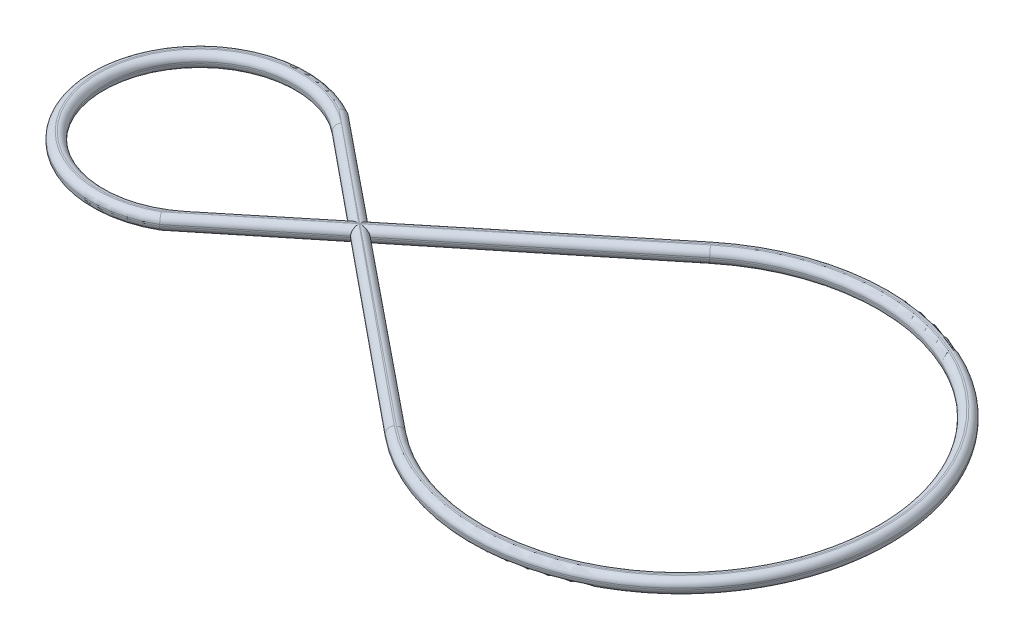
ISO-10303-21;
HEADER;
FILE_DESCRIPTION(('STEP AP214'),'2;1');
FILE_NAME('part.step','',(''),(''),'','','');
FILE_SCHEMA(('AUTOMOTIVE_DESIGN { 1 0 10303 214 1 1 1 1 }'));
ENDSEC;
DATA;
#1=APPLICATION_CONTEXT('core data for automotive mechanical design processes');
#2=APPLICATION_PROTOCOL_DEFINITION('international standard','automotive_design',2000,#1);
#3=PRODUCT_CONTEXT('',#1,'mechanical');
#4=PRODUCT('Part','Part','',(#3));
#5=PRODUCT_RELATED_PRODUCT_CATEGORY('part','',(#4));
#6=PRODUCT_DEFINITION_FORMATION('','',#4);
#7=PRODUCT_DEFINITION_CONTEXT('part definition',#1,'design');
#8=PRODUCT_DEFINITION('design','',#6,#7);
#9=PRODUCT_DEFINITION_SHAPE('','',#8);
#10=(LENGTH_UNIT() NAMED_UNIT(*) SI_UNIT(.MILLI.,.METRE.));
#11=(NAMED_UNIT(*) PLANE_ANGLE_UNIT() SI_UNIT($,.RADIAN.));
#12=(NAMED_UNIT(*) SI_UNIT($,.STERADIAN.) SOLID_ANGLE_UNIT());
#13=UNCERTAINTY_MEASURE_WITH_UNIT(LENGTH_MEASURE(1.E-05),#10,'distance_accuracy_value','');
#14=(GEOMETRIC_REPRESENTATION_CONTEXT(3) GLOBAL_UNCERTAINTY_ASSIGNED_CONTEXT((#13)) GLOBAL_UNIT_ASSIGNED_CONTEXT((#10,
#11,#12)) REPRESENTATION_CONTEXT('',''));
#15=CARTESIAN_POINT('',(0.,0.,0.));
#16=DIRECTION('',(0.,0.,1.));
#17=DIRECTION('',(1.,0.,0.));
#18=AXIS2_PLACEMENT_3D('',#15,#16,#17);
#19=CARTESIAN_POINT('',(166.,5.,0.));
#20=DIRECTION('',(0.,1.,0.));
#21=DIRECTION('',(0.,0.,1.));
#22=AXIS2_PLACEMENT_3D('',#19,#20,#21);
#23=PLANE('',#22);
#24=DIRECTION('',(-0.776849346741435,0.,0.629686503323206));
#25=VECTOR('',#24,1.);
#26=CARTESIAN_POINT('',(122.079366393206,5.,-54.1852419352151));
#27=LINE('',#26,#25);
#28=CARTESIAN_POINT('',(55.2305939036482,5.,0.));
#29=VERTEX_POINT('',#28);
#30=CARTESIAN_POINT('',(122.079366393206,5.,-54.185241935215));
#31=VERTEX_POINT('',#30);
#32=EDGE_CURVE('E287',#29,#31,#27,.F.);
#33=ORIENTED_EDGE('',*,*,#32,.T.);
#34=CARTESIAN_POINT('',(166.,5.,0.));
#35=DIRECTION('',(0.,1.,0.));
#36=DIRECTION('',(0.,0.,1.));
#37=AXIS2_PLACEMENT_3D('',#34,#35,#36);
#38=CIRCLE('',#37,69.75);
#39=CARTESIAN_POINT('',(122.079366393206,5.,54.1852419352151));
#40=VERTEX_POINT('',#39);
#41=EDGE_CURVE('E289',#31,#40,#38,.F.);
#42=ORIENTED_EDGE('',*,*,#41,.T.);
#43=DIRECTION('',(0.776849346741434,0.,0.629686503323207));
#44=VECTOR('',#43,1.);
#45=CARTESIAN_POINT('',(122.079366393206,5.,54.1852419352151));
#46=LINE('',#45,#44);
#47=EDGE_CURVE('E285',#40,#29,#46,.F.);
#48=ORIENTED_EDGE('',*,*,#47,.T.);
#49=EDGE_LOOP('',(#33,#42,#48));
#50=FACE_BOUND('',#49,.T.);
#51=DIRECTION('',(-0.774535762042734,0.,-0.632530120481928));
#52=VECTOR('',#51,1.);
#53=CARTESIAN_POINT('',(121.564759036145,5.,54.411137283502));
#54=LINE('',#53,#52);
#55=CARTESIAN_POINT('',(21.980421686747,5.,-26.915117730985));
#56=VERTEX_POINT('',#55);
#57=CARTESIAN_POINT('',(54.9380952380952,5.,0.));
#58=VERTEX_POINT('',#57);
#59=EDGE_CURVE('E280',#56,#58,#54,.F.);
#60=ORIENTED_EDGE('',*,*,#59,.T.);
#61=DIRECTION('',(0.774535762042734,0.,-0.632530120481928));
#62=VECTOR('',#61,1.);
#63=CARTESIAN_POINT('',(121.564759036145,5.,-54.411137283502));
#64=LINE('',#63,#62);
#65=CARTESIAN_POINT('',(21.980421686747,5.,26.915117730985));
#66=VERTEX_POINT('',#65);
#67=EDGE_CURVE('E282',#58,#66,#64,.F.);
#68=ORIENTED_EDGE('',*,*,#67,.T.);
#69=CARTESIAN_POINT('',(0.,5.,0.));
#70=DIRECTION('',(0.,1.,0.));
#71=DIRECTION('',(0.,0.,1.));
#72=AXIS2_PLACEMENT_3D('',#69,#70,#71);
#73=CIRCLE('',#72,34.75);
#74=EDGE_CURVE('E278',#66,#56,#73,.F.);
#75=ORIENTED_EDGE('',*,*,#74,.T.);
#76=EDGE_LOOP('',(#60,#68,#75));
#77=FACE_BOUND('',#76,.T.);
#78=DIRECTION('',(0.774535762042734,0.,0.632530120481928));
#79=VECTOR('',#78,1.);
#80=CARTESIAN_POINT('',(121.564759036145,5.,54.411137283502));
#81=LINE('',#80,#79);
#82=CARTESIAN_POINT('',(55.0837969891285,5.,0.118988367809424));
#83=VERTEX_POINT('',#82);
#84=CARTESIAN_POINT('',(121.564759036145,5.,54.411137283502));
#85=VERTEX_POINT('',#84);
#86=EDGE_CURVE('E271',#83,#85,#81,.T.);
#87=ORIENTED_EDGE('',*,*,#86,.T.);
#88=CARTESIAN_POINT('',(166.,5.,0.));
#89=DIRECTION('',(0.,1.,0.));
#90=DIRECTION('',(0.,0.,1.));
#91=AXIS2_PLACEMENT_3D('',#88,#89,#90);
#92=CIRCLE('',#91,70.25);
#93=CARTESIAN_POINT('',(121.564759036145,5.,-54.411137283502));
#94=VERTEX_POINT('',#93);
#95=EDGE_CURVE('E275',#85,#94,#92,.T.);
#96=ORIENTED_EDGE('',*,*,#95,.T.);
#97=DIRECTION('',(-0.774535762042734,0.,0.632530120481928));
#98=VECTOR('',#97,1.);
#99=CARTESIAN_POINT('',(56.5016730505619,5.,-1.27690690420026));
#100=LINE('',#99,#98);
#101=CARTESIAN_POINT('',(55.0837969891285,5.,-0.118988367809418));
#102=VERTEX_POINT('',#101);
#103=EDGE_CURVE('E273',#94,#102,#100,.T.);
#104=ORIENTED_EDGE('',*,*,#103,.T.);
#105=DIRECTION('',(-0.776849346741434,0.,-0.629686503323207));
#106=VECTOR('',#105,1.);
#107=CARTESIAN_POINT('',(17.2914923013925,5.,-30.7520889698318));
#108=LINE('',#107,#106);
#109=CARTESIAN_POINT('',(17.4327651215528,5.,-30.6375782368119));
#110=VERTEX_POINT('',#109);
#111=EDGE_CURVE('E267',#102,#110,#108,.T.);
#112=ORIENTED_EDGE('',*,*,#111,.T.);
#113=CARTESIAN_POINT('',(0.,5.,0.));
#114=DIRECTION('',(0.,1.,0.));
#115=DIRECTION('',(0.,0.,1.));
#116=AXIS2_PLACEMENT_3D('',#113,#114,#115);
#117=CIRCLE('',#116,35.25);
#118=CARTESIAN_POINT('',(17.4327651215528,5.,30.6375782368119));
#119=VERTEX_POINT('',#118);
#120=EDGE_CURVE('E265',#110,#119,#117,.T.);
#121=ORIENTED_EDGE('',*,*,#120,.T.);
#122=DIRECTION('',(0.776849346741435,0.,-0.629686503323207));
#123=VECTOR('',#122,1.);
#124=CARTESIAN_POINT('',(53.6616856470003,5.,1.27170133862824));
#125=LINE('',#124,#123);
#126=EDGE_CURVE('E269',#119,#83,#125,.T.);
#127=ORIENTED_EDGE('',*,*,#126,.T.);
#128=EDGE_LOOP('',(#87,#96,#104,#112,#121,#127));
#129=FACE_BOUND('',#128,.T.);
#130=ADVANCED_FACE('F27',(#50,#77,#129),#23,.T.);
#131=CARTESIAN_POINT('',(166.,0.,0.));
#132=DIRECTION('',(0.,1.,0.));
#133=DIRECTION('',(0.,0.,1.));
#134=AXIS2_PLACEMENT_3D('',#131,#132,#133);
#135=PLANE('',#134);
#136=DIRECTION('',(0.776849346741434,0.,0.629686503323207));
#137=VECTOR('',#136,1.);
#138=CARTESIAN_POINT('',(122.079366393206,0.,54.1852419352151));
#139=LINE('',#138,#137);
#140=CARTESIAN_POINT('',(55.2305939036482,0.,0.));
#141=VERTEX_POINT('',#140);
#142=CARTESIAN_POINT('',(122.079366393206,0.,54.1852419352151));
#143=VERTEX_POINT('',#142);
#144=EDGE_CURVE('E230',#141,#143,#139,.T.);
#145=ORIENTED_EDGE('',*,*,#144,.T.);
#146=CARTESIAN_POINT('',(166.,0.,0.));
#147=DIRECTION('',(0.,1.,0.));
#148=DIRECTION('',(0.,0.,1.));
#149=AXIS2_PLACEMENT_3D('',#146,#147,#148);
#150=CIRCLE('',#149,69.75);
#151=CARTESIAN_POINT('',(122.079366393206,0.,-54.1852419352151));
#152=VERTEX_POINT('',#151);
#153=EDGE_CURVE('E234',#143,#152,#150,.T.);
#154=ORIENTED_EDGE('',*,*,#153,.T.);
#155=DIRECTION('',(-0.776849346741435,0.,0.629686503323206));
#156=VECTOR('',#155,1.);
#157=CARTESIAN_POINT('',(57.3870059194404,0.,-1.74791103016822));
#158=LINE('',#157,#156);
#159=EDGE_CURVE('E232',#152,#141,#158,.T.);
#160=ORIENTED_EDGE('',*,*,#159,.T.);
#161=EDGE_LOOP('',(#145,#154,#160));
#162=FACE_BOUND('',#161,.T.);
#163=DIRECTION('',(-0.774535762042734,0.,0.632530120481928));
#164=VECTOR('',#163,1.);
#165=CARTESIAN_POINT('',(121.564759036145,0.,-54.411137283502));
#166=LINE('',#165,#164);
#167=CARTESIAN_POINT('',(55.0837969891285,0.,-0.118988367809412));
#168=VERTEX_POINT('',#167);
#169=CARTESIAN_POINT('',(121.564759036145,0.,-54.411137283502));
#170=VERTEX_POINT('',#169);
#171=EDGE_CURVE('E223',#168,#170,#166,.F.);
#172=ORIENTED_EDGE('',*,*,#171,.T.);
#173=CARTESIAN_POINT('',(166.,0.,0.));
#174=DIRECTION('',(0.,1.,0.));
#175=DIRECTION('',(0.,0.,1.));
#176=AXIS2_PLACEMENT_3D('',#173,#174,#175);
#177=CIRCLE('',#176,70.25);
#178=CARTESIAN_POINT('',(121.564759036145,0.,54.411137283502));
#179=VERTEX_POINT('',#178);
#180=EDGE_CURVE('E228',#170,#179,#177,.F.);
#181=ORIENTED_EDGE('',*,*,#180,.T.);
#182=DIRECTION('',(0.774535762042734,0.,0.632530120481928));
#183=VECTOR('',#182,1.);
#184=CARTESIAN_POINT('',(121.564759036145,0.,54.411137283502));
#185=LINE('',#184,#183);
#186=CARTESIAN_POINT('',(55.0837969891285,0.,0.118988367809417));
#187=VERTEX_POINT('',#186);
#188=EDGE_CURVE('E225',#179,#187,#185,.F.);
#189=ORIENTED_EDGE('',*,*,#188,.T.);
#190=DIRECTION('',(0.776849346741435,0.,-0.629686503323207));
#191=VECTOR('',#190,1.);
#192=CARTESIAN_POINT('',(122.079366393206,0.,-54.1852419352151));
#193=LINE('',#192,#191);
#194=CARTESIAN_POINT('',(17.4327651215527,0.,30.637578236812));
#195=VERTEX_POINT('',#194);
#196=EDGE_CURVE('E221',#187,#195,#193,.F.);
#197=ORIENTED_EDGE('',*,*,#196,.T.);
#198=CARTESIAN_POINT('',(0.,0.,0.));
#199=DIRECTION('',(0.,1.,0.));
#200=DIRECTION('',(0.,0.,1.));
#201=AXIS2_PLACEMENT_3D('',#198,#199,#200);
#202=CIRCLE('',#201,35.25);
#203=CARTESIAN_POINT('',(17.4327651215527,0.,-30.637578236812));
#204=VERTEX_POINT('',#203);
#205=EDGE_CURVE('E214',#195,#204,#202,.F.);
#206=ORIENTED_EDGE('',*,*,#205,.T.);
#207=DIRECTION('',(-0.776849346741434,0.,-0.629686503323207));
#208=VECTOR('',#207,1.);
#209=CARTESIAN_POINT('',(122.079366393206,0.,54.1852419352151));
#210=LINE('',#209,#208);
#211=EDGE_CURVE('E216',#204,#168,#210,.F.);
#212=ORIENTED_EDGE('',*,*,#211,.T.);
#213=EDGE_LOOP('',(#172,#181,#189,#197,#206,#212));
#214=FACE_BOUND('',#213,.T.);
#215=DIRECTION('',(0.774535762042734,0.,-0.632530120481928));
#216=VECTOR('',#215,1.);
#217=CARTESIAN_POINT('',(52.8041451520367,0.,1.74270546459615));
#218=LINE('',#217,#216);
#219=CARTESIAN_POINT('',(21.980421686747,0.,26.915117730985));
#220=VERTEX_POINT('',#219);
#221=CARTESIAN_POINT('',(54.9380952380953,0.,0.));
#222=VERTEX_POINT('',#221);
#223=EDGE_CURVE('E209',#220,#222,#218,.T.);
#224=ORIENTED_EDGE('',*,*,#223,.T.);
#225=DIRECTION('',(-0.774535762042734,0.,-0.632530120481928));
#226=VECTOR('',#225,1.);
#227=CARTESIAN_POINT('',(21.980421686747,0.,-26.9151177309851));
#228=LINE('',#227,#226);
#229=CARTESIAN_POINT('',(21.980421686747,0.,-26.915117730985));
#230=VERTEX_POINT('',#229);
#231=EDGE_CURVE('E194',#222,#230,#228,.T.);
#232=ORIENTED_EDGE('',*,*,#231,.T.);
#233=CARTESIAN_POINT('',(0.,0.,0.));
#234=DIRECTION('',(0.,1.,0.));
#235=DIRECTION('',(0.,0.,1.));
#236=AXIS2_PLACEMENT_3D('',#233,#234,#235);
#237=CIRCLE('',#236,34.75);
#238=EDGE_CURVE('E203',#230,#220,#237,.T.);
#239=ORIENTED_EDGE('',*,*,#238,.T.);
#240=EDGE_LOOP('',(#224,#232,#239));
#241=FACE_BOUND('',#240,.T.);
#242=ADVANCED_FACE('F212',(#162,#214,#241),#135,.F.);
#243=CARTESIAN_POINT('',(166.,5.,0.));
#244=DIRECTION('',(0.,-1.,0.));
#245=DIRECTION('',(0.,0.,-1.));
#246=AXIS2_PLACEMENT_3D('',#243,#244,#245);
#247=CYLINDRICAL_SURFACE('',#246,72.5);
#248=DIRECTION('',(0.,-1.,0.));
#249=VECTOR('',#248,1.);
#250=CARTESIAN_POINT('',(120.14156626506,5.,56.1538427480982));
#251=LINE('',#250,#249);
#252=CARTESIAN_POINT('',(120.14156626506,2.75,56.1538427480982));
#253=VERTEX_POINT('',#252);
#254=CARTESIAN_POINT('',(120.14156626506,2.25,56.1538427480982));
#255=VERTEX_POINT('',#254);
#256=EDGE_CURVE('E328',#253,#255,#251,.T.);
#257=ORIENTED_EDGE('',*,*,#256,.T.);
#258=CARTESIAN_POINT('',(166.,2.25,0.));
#259=DIRECTION('',(0.,1.,0.));
#260=DIRECTION('',(0.,0.,1.));
#261=AXIS2_PLACEMENT_3D('',#258,#259,#260);
#262=CIRCLE('',#261,72.5);
#263=CARTESIAN_POINT('',(120.14156626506,2.25,-56.1538427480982));
#264=VERTEX_POINT('',#263);
#265=EDGE_CURVE('E257',#255,#264,#262,.T.);
#266=ORIENTED_EDGE('',*,*,#265,.T.);
#267=DIRECTION('',(0.,-1.,0.));
#268=VECTOR('',#267,1.);
#269=CARTESIAN_POINT('',(120.14156626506,5.,-56.1538427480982));
#270=LINE('',#269,#268);
#271=CARTESIAN_POINT('',(120.14156626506,2.75,-56.1538427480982));
#272=VERTEX_POINT('',#271);
#273=EDGE_CURVE('E210',#272,#264,#270,.T.);
#274=ORIENTED_EDGE('',*,*,#273,.F.);
#275=CARTESIAN_POINT('',(166.,2.75,0.));
#276=DIRECTION('',(0.,1.,0.));
#277=DIRECTION('',(0.,0.,1.));
#278=AXIS2_PLACEMENT_3D('',#275,#276,#277);
#279=CIRCLE('',#278,72.5);
#280=EDGE_CURVE('E254',#272,#253,#279,.F.);
#281=ORIENTED_EDGE('',*,*,#280,.T.);
#282=EDGE_LOOP('',(#257,#266,#274,#281));
#283=FACE_BOUND('',#282,.T.);
#284=ADVANCED_FACE('F29',(#283),#247,.T.);
#285=CARTESIAN_POINT('',(55.0784802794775,5.,-3.01961236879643));
#286=DIRECTION('',(0.632530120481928,0.,0.774535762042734));
#287=DIRECTION('',(0.774535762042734,0.,-0.632530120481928));
#288=AXIS2_PLACEMENT_3D('',#285,#286,#287);
#289=PLANE('',#288);
#290=ORIENTED_EDGE('',*,*,#273,.T.);
#291=DIRECTION('',(-0.774535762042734,0.,0.632530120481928));
#292=VECTOR('',#291,1.);
#293=CARTESIAN_POINT('',(55.0784802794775,2.25,-3.01961236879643));
#294=LINE('',#293,#292);
#295=CARTESIAN_POINT('',(55.0784802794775,2.25,-3.01961236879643));
#296=VERTEX_POINT('',#295);
#297=EDGE_CURVE('E252',#264,#296,#294,.T.);
#298=ORIENTED_EDGE('',*,*,#297,.T.);
#299=DIRECTION('',(0.,-1.,0.));
#300=VECTOR('',#299,1.);
#301=CARTESIAN_POINT('',(55.0784802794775,5.,-3.01961236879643));
#302=LINE('',#301,#300);
#303=CARTESIAN_POINT('',(55.0784802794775,2.75,-3.01961236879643));
#304=VERTEX_POINT('',#303);
#305=EDGE_CURVE('E363',#304,#296,#302,.T.);
#306=ORIENTED_EDGE('',*,*,#305,.F.);
#307=DIRECTION('',(-0.774535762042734,0.,0.632530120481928));
#308=VECTOR('',#307,1.);
#309=CARTESIAN_POINT('',(120.14156626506,2.75,-56.1538427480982));
#310=LINE('',#309,#308);
#311=EDGE_CURVE('E250',#304,#272,#310,.F.);
#312=ORIENTED_EDGE('',*,*,#311,.T.);
#313=EDGE_LOOP('',(#290,#298,#306,#312));
#314=FACE_BOUND('',#313,.T.);
#315=ADVANCED_FACE('F369',(#314),#289,.F.);
#316=CARTESIAN_POINT('',(18.7082869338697,5.,-32.5));
#317=DIRECTION('',(-0.629686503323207,0.,0.776849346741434));
#318=DIRECTION('',(0.776849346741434,0.,0.629686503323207));
#319=AXIS2_PLACEMENT_3D('',#316,#317,#318);
#320=PLANE('',#319);
#321=DIRECTION('',(0.,-1.,0.));
#322=VECTOR('',#321,1.);
#323=CARTESIAN_POINT('',(18.7082869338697,5.,-32.5));
#324=LINE('',#323,#322);
#325=CARTESIAN_POINT('',(18.7082869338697,2.75,-32.5));
#326=VERTEX_POINT('',#325);
#327=CARTESIAN_POINT('',(18.7082869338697,2.25,-32.5));
#328=VERTEX_POINT('',#327);
#329=EDGE_CURVE('E361',#326,#328,#324,.T.);
#330=ORIENTED_EDGE('',*,*,#329,.F.);
#331=DIRECTION('',(-0.776849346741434,0.,-0.629686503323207));
#332=VECTOR('',#331,1.);
#333=CARTESIAN_POINT('',(55.0784802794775,2.75,-3.01961236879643));
#334=LINE('',#333,#332);
#335=EDGE_CURVE('E305',#326,#304,#334,.F.);
#336=ORIENTED_EDGE('',*,*,#335,.T.);
#337=ORIENTED_EDGE('',*,*,#305,.T.);
#338=DIRECTION('',(-0.776849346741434,0.,-0.629686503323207));
#339=VECTOR('',#338,1.);
#340=CARTESIAN_POINT('',(18.7082869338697,2.25,-32.5));
#341=LINE('',#340,#339);
#342=EDGE_CURVE('E42',#296,#328,#341,.T.);
#343=ORIENTED_EDGE('',*,*,#342,.T.);
#344=EDGE_LOOP('',(#330,#336,#337,#343));
#345=FACE_BOUND('',#344,.T.);
#346=ADVANCED_FACE('F466',(#345),#320,.F.);
#347=CARTESIAN_POINT('',(0.,5.,0.));
#348=DIRECTION('',(0.,-1.,0.));
#349=DIRECTION('',(0.,0.,-1.));
#350=AXIS2_PLACEMENT_3D('',#347,#348,#349);
#351=CYLINDRICAL_SURFACE('',#350,37.5);
#352=ORIENTED_EDGE('',*,*,#329,.T.);
#353=CARTESIAN_POINT('',(0.,2.25,0.));
#354=DIRECTION('',(0.,1.,0.));
#355=DIRECTION('',(0.,0.,1.));
#356=AXIS2_PLACEMENT_3D('',#353,#354,#355);
#357=CIRCLE('',#356,37.5);
#358=CARTESIAN_POINT('',(18.7082869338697,2.25,32.5));
#359=VERTEX_POINT('',#358);
#360=EDGE_CURVE('E308',#328,#359,#357,.T.);
#361=ORIENTED_EDGE('',*,*,#360,.T.);
#362=DIRECTION('',(0.,-1.,0.));
#363=VECTOR('',#362,1.);
#364=CARTESIAN_POINT('',(18.7082869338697,5.,32.5));
#365=LINE('',#364,#363);
#366=CARTESIAN_POINT('',(18.7082869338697,2.75,32.5));
#367=VERTEX_POINT('',#366);
#368=EDGE_CURVE('E358',#367,#359,#365,.T.);
#369=ORIENTED_EDGE('',*,*,#368,.F.);
#370=CARTESIAN_POINT('',(0.,2.75,0.));
#371=DIRECTION('',(0.,1.,0.));
#372=DIRECTION('',(0.,0.,1.));
#373=AXIS2_PLACEMENT_3D('',#370,#371,#372);
#374=CIRCLE('',#373,37.5);
#375=EDGE_CURVE('E49',#367,#326,#374,.F.);
#376=ORIENTED_EDGE('',*,*,#375,.T.);
#377=EDGE_LOOP('',(#352,#361,#369,#376));
#378=FACE_BOUND('',#377,.T.);
#379=ADVANCED_FACE('F462',(#378),#351,.T.);
#380=CARTESIAN_POINT('',(18.7082869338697,5.,32.5));
#381=DIRECTION('',(-0.629686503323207,0.,-0.776849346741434));
#382=DIRECTION('',(-0.776849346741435,0.,0.629686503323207));
#383=AXIS2_PLACEMENT_3D('',#380,#381,#382);
#384=PLANE('',#383);
#385=ORIENTED_EDGE('',*,*,#368,.T.);
#386=DIRECTION('',(0.776849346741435,0.,-0.629686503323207));
#387=VECTOR('',#386,1.);
#388=CARTESIAN_POINT('',(18.7082869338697,2.25,32.5));
#389=LINE('',#388,#387);
#390=CARTESIAN_POINT('',(55.0784802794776,2.25,3.01961236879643));
#391=VERTEX_POINT('',#390);
#392=EDGE_CURVE('E302',#359,#391,#389,.T.);
#393=ORIENTED_EDGE('',*,*,#392,.T.);
#394=DIRECTION('',(0.,-1.,0.));
#395=VECTOR('',#394,1.);
#396=CARTESIAN_POINT('',(55.0784802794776,5.,3.01961236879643));
#397=LINE('',#396,#395);
#398=CARTESIAN_POINT('',(55.0784802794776,2.75,3.01961236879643));
#399=VERTEX_POINT('',#398);
#400=EDGE_CURVE('E355',#399,#391,#397,.T.);
#401=ORIENTED_EDGE('',*,*,#400,.F.);
#402=DIRECTION('',(0.776849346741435,0.,-0.629686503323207));
#403=VECTOR('',#402,1.);
#404=CARTESIAN_POINT('',(18.7082869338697,2.75,32.5));
#405=LINE('',#404,#403);
#406=EDGE_CURVE('E300',#399,#367,#405,.F.);
#407=ORIENTED_EDGE('',*,*,#406,.T.);
#408=EDGE_LOOP('',(#385,#393,#401,#407));
#409=FACE_BOUND('',#408,.T.);
#410=ADVANCED_FACE('F458',(#409),#384,.F.);
#411=CARTESIAN_POINT('',(55.0784802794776,5.,3.01961236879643));
#412=DIRECTION('',(0.632530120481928,0.,-0.774535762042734));
#413=DIRECTION('',(-0.774535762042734,0.,-0.632530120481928));
#414=AXIS2_PLACEMENT_3D('',#411,#412,#413);
#415=PLANE('',#414);
#416=ORIENTED_EDGE('',*,*,#400,.T.);
#417=DIRECTION('',(0.774535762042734,0.,0.632530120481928));
#418=VECTOR('',#417,1.);
#419=CARTESIAN_POINT('',(55.0784802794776,2.25,3.01961236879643));
#420=LINE('',#419,#418);
#421=EDGE_CURVE('E247',#391,#255,#420,.T.);
#422=ORIENTED_EDGE('',*,*,#421,.T.);
#423=ORIENTED_EDGE('',*,*,#256,.F.);
#424=DIRECTION('',(0.774535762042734,0.,0.632530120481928));
#425=VECTOR('',#424,1.);
#426=CARTESIAN_POINT('',(55.0784802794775,2.75,3.01961236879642));
#427=LINE('',#426,#425);
#428=EDGE_CURVE('E245',#253,#399,#427,.F.);
#429=ORIENTED_EDGE('',*,*,#428,.T.);
#430=EDGE_LOOP('',(#416,#422,#423,#429));
#431=FACE_BOUND('',#430,.T.);
#432=ADVANCED_FACE('F449',(#431),#415,.F.);
#433=CARTESIAN_POINT('',(0.,5.,0.));
#434=DIRECTION('',(0.,-1.,0.));
#435=DIRECTION('',(0.,0.,-1.));
#436=AXIS2_PLACEMENT_3D('',#433,#434,#435);
#437=CYLINDRICAL_SURFACE('',#436,32.5);
#438=DIRECTION('',(0.,-1.,0.));
#439=VECTOR('',#438,1.);
#440=CARTESIAN_POINT('',(20.5572289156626,5.,25.1724122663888));
#441=LINE('',#440,#439);
#442=CARTESIAN_POINT('',(20.5572289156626,2.75,25.1724122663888));
#443=VERTEX_POINT('',#442);
#444=CARTESIAN_POINT('',(20.5572289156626,2.25,25.1724122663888));
#445=VERTEX_POINT('',#444);
#446=EDGE_CURVE('E315',#443,#445,#441,.T.);
#447=ORIENTED_EDGE('',*,*,#446,.T.);
#448=CARTESIAN_POINT('',(0.,2.25,0.));
#449=DIRECTION('',(0.,1.,0.));
#450=DIRECTION('',(0.,0.,1.));
#451=AXIS2_PLACEMENT_3D('',#448,#449,#450);
#452=CIRCLE('',#451,32.5);
#453=CARTESIAN_POINT('',(20.5572289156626,2.25,-25.1724122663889));
#454=VERTEX_POINT('',#453);
#455=EDGE_CURVE('E11',#445,#454,#452,.F.);
#456=ORIENTED_EDGE('',*,*,#455,.T.);
#457=DIRECTION('',(0.,-1.,0.));
#458=VECTOR('',#457,1.);
#459=CARTESIAN_POINT('',(20.5572289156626,5.,-25.1724122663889));
#460=LINE('',#459,#458);
#461=CARTESIAN_POINT('',(20.5572289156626,2.75,-25.1724122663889));
#462=VERTEX_POINT('',#461);
#463=EDGE_CURVE('E317',#462,#454,#460,.T.);
#464=ORIENTED_EDGE('',*,*,#463,.F.);
#465=CARTESIAN_POINT('',(0.,2.75,0.));
#466=DIRECTION('',(0.,1.,0.));
#467=DIRECTION('',(0.,0.,1.));
#468=AXIS2_PLACEMENT_3D('',#465,#466,#467);
#469=CIRCLE('',#468,32.5);
#470=EDGE_CURVE('E35',#462,#443,#469,.T.);
#471=ORIENTED_EDGE('',*,*,#470,.T.);
#472=EDGE_LOOP('',(#447,#456,#464,#471));
#473=FACE_BOUND('',#472,.T.);
#474=ADVANCED_FACE('F314',(#473),#437,.F.);
#475=CARTESIAN_POINT('',(20.5572289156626,5.,25.1724122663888));
#476=DIRECTION('',(-0.632530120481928,0.,-0.774535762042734));
#477=DIRECTION('',(-0.774535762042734,0.,0.632530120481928));
#478=AXIS2_PLACEMENT_3D('',#475,#476,#477);
#479=PLANE('',#478);
#480=DIRECTION('',(0.,-1.,0.));
#481=VECTOR('',#480,1.);
#482=CARTESIAN_POINT('',(51.3809523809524,5.,0.));
#483=LINE('',#482,#481);
#484=CARTESIAN_POINT('',(51.3809523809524,2.75,0.));
#485=VERTEX_POINT('',#484);
#486=CARTESIAN_POINT('',(51.3809523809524,2.25,0.));
#487=VERTEX_POINT('',#486);
#488=EDGE_CURVE('E329',#485,#487,#483,.T.);
#489=ORIENTED_EDGE('',*,*,#488,.T.);
#490=DIRECTION('',(0.774535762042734,0.,-0.632530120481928));
#491=VECTOR('',#490,1.);
#492=CARTESIAN_POINT('',(20.5572289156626,2.25,25.1724122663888));
#493=LINE('',#492,#491);
#494=EDGE_CURVE('E243',#487,#445,#493,.F.);
#495=ORIENTED_EDGE('',*,*,#494,.T.);
#496=ORIENTED_EDGE('',*,*,#446,.F.);
#497=DIRECTION('',(0.774535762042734,0.,-0.632530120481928));
#498=VECTOR('',#497,1.);
#499=CARTESIAN_POINT('',(20.5572289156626,2.75,25.1724122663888));
#500=LINE('',#499,#498);
#501=EDGE_CURVE('E240',#443,#485,#500,.T.);
#502=ORIENTED_EDGE('',*,*,#501,.T.);
#503=EDGE_LOOP('',(#489,#495,#496,#502));
#504=FACE_BOUND('',#503,.T.);
#505=ADVANCED_FACE('F324',(#504),#479,.T.);
#506=CARTESIAN_POINT('',(20.5572289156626,5.,-25.1724122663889));
#507=DIRECTION('',(-0.632530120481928,0.,0.774535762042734));
#508=DIRECTION('',(0.774535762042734,0.,0.632530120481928));
#509=AXIS2_PLACEMENT_3D('',#506,#507,#508);
#510=PLANE('',#509);
#511=ORIENTED_EDGE('',*,*,#463,.T.);
#512=DIRECTION('',(-0.774535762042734,0.,-0.632530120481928));
#513=VECTOR('',#512,1.);
#514=CARTESIAN_POINT('',(51.3809523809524,2.25,0.));
#515=LINE('',#514,#513);
#516=EDGE_CURVE('E196',#454,#487,#515,.F.);
#517=ORIENTED_EDGE('',*,*,#516,.T.);
#518=ORIENTED_EDGE('',*,*,#488,.F.);
#519=DIRECTION('',(-0.774535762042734,0.,-0.632530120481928));
#520=VECTOR('',#519,1.);
#521=CARTESIAN_POINT('',(20.5572289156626,2.75,-25.1724122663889));
#522=LINE('',#521,#520);
#523=EDGE_CURVE('E237',#485,#462,#522,.T.);
#524=ORIENTED_EDGE('',*,*,#523,.T.);
#525=EDGE_LOOP('',(#511,#517,#518,#524));
#526=FACE_BOUND('',#525,.T.);
#527=ADVANCED_FACE('F347',(#526),#510,.T.);
#528=CARTESIAN_POINT('',(166.,5.,0.));
#529=DIRECTION('',(0.,-1.,0.));
#530=DIRECTION('',(0.,0.,-1.));
#531=AXIS2_PLACEMENT_3D('',#528,#529,#530);
#532=CYLINDRICAL_SURFACE('',#531,67.5);
#533=DIRECTION('',(0.,-1.,0.));
#534=VECTOR('',#533,1.);
#535=CARTESIAN_POINT('',(123.496161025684,5.,-52.4373309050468));
#536=LINE('',#535,#534);
#537=CARTESIAN_POINT('',(123.496161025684,2.75,-52.4373309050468));
#538=VERTEX_POINT('',#537);
#539=CARTESIAN_POINT('',(123.496161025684,2.25,-52.4373309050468));
#540=VERTEX_POINT('',#539);
#541=EDGE_CURVE('E349',#538,#540,#536,.T.);
#542=ORIENTED_EDGE('',*,*,#541,.T.);
#543=CARTESIAN_POINT('',(166.,2.25,0.));
#544=DIRECTION('',(0.,1.,0.));
#545=DIRECTION('',(0.,0.,1.));
#546=AXIS2_PLACEMENT_3D('',#543,#544,#545);
#547=CIRCLE('',#546,67.5);
#548=CARTESIAN_POINT('',(123.496161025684,2.25,52.4373309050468));
#549=VERTEX_POINT('',#548);
#550=EDGE_CURVE('E262',#540,#549,#547,.F.);
#551=ORIENTED_EDGE('',*,*,#550,.T.);
#552=DIRECTION('',(0.,-1.,0.));
#553=VECTOR('',#552,1.);
#554=CARTESIAN_POINT('',(123.496161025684,5.,52.4373309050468));
#555=LINE('',#554,#553);
#556=CARTESIAN_POINT('',(123.496161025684,2.75,52.4373309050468));
#557=VERTEX_POINT('',#556);
#558=EDGE_CURVE('E770',#557,#549,#555,.T.);
#559=ORIENTED_EDGE('',*,*,#558,.F.);
#560=CARTESIAN_POINT('',(166.,2.75,0.));
#561=DIRECTION('',(0.,1.,0.));
#562=DIRECTION('',(0.,0.,1.));
#563=AXIS2_PLACEMENT_3D('',#560,#561,#562);
#564=CIRCLE('',#563,67.5);
#565=EDGE_CURVE('E259',#557,#538,#564,.T.);
#566=ORIENTED_EDGE('',*,*,#565,.T.);
#567=EDGE_LOOP('',(#542,#551,#559,#566));
#568=FACE_BOUND('',#567,.T.);
#569=ADVANCED_FACE('F438',(#568),#532,.F.);
#570=CARTESIAN_POINT('',(58.8038005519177,5.,0.));
#571=DIRECTION('',(0.629686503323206,0.,0.776849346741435));
#572=DIRECTION('',(0.776849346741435,0.,-0.629686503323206));
#573=AXIS2_PLACEMENT_3D('',#570,#571,#572);
#574=PLANE('',#573);
#575=ORIENTED_EDGE('',*,*,#541,.F.);
#576=DIRECTION('',(-0.776849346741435,0.,0.629686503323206));
#577=VECTOR('',#576,1.);
#578=CARTESIAN_POINT('',(58.8038005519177,2.75,0.));
#579=LINE('',#578,#577);
#580=CARTESIAN_POINT('',(58.8038005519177,2.75,0.));
#581=VERTEX_POINT('',#580);
#582=EDGE_CURVE('E294',#538,#581,#579,.T.);
#583=ORIENTED_EDGE('',*,*,#582,.T.);
#584=DIRECTION('',(0.,-1.,0.));
#585=VECTOR('',#584,1.);
#586=CARTESIAN_POINT('',(58.8038005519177,5.,0.));
#587=LINE('',#586,#585);
#588=CARTESIAN_POINT('',(58.8038005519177,2.25,0.));
#589=VERTEX_POINT('',#588);
#590=EDGE_CURVE('E766',#581,#589,#587,.T.);
#591=ORIENTED_EDGE('',*,*,#590,.T.);
#592=DIRECTION('',(-0.776849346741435,0.,0.629686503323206));
#593=VECTOR('',#592,1.);
#594=CARTESIAN_POINT('',(123.496161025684,2.25,-52.4373309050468));
#595=LINE('',#594,#593);
#596=EDGE_CURVE('E292',#589,#540,#595,.F.);
#597=ORIENTED_EDGE('',*,*,#596,.T.);
#598=EDGE_LOOP('',(#575,#583,#591,#597));
#599=FACE_BOUND('',#598,.T.);
#600=ADVANCED_FACE('F434',(#599),#574,.T.);
#601=CARTESIAN_POINT('',(58.8038005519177,5.,0.));
#602=DIRECTION('',(0.629686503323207,0.,-0.776849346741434));
#603=DIRECTION('',(-0.776849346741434,0.,-0.629686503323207));
#604=AXIS2_PLACEMENT_3D('',#601,#602,#603);
#605=PLANE('',#604);
#606=ORIENTED_EDGE('',*,*,#558,.T.);
#607=DIRECTION('',(0.776849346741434,0.,0.629686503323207));
#608=VECTOR('',#607,1.);
#609=CARTESIAN_POINT('',(58.8038005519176,2.25,0.));
#610=LINE('',#609,#608);
#611=EDGE_CURVE('E298',#549,#589,#610,.F.);
#612=ORIENTED_EDGE('',*,*,#611,.T.);
#613=ORIENTED_EDGE('',*,*,#590,.F.);
#614=DIRECTION('',(0.776849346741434,0.,0.629686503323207));
#615=VECTOR('',#614,1.);
#616=CARTESIAN_POINT('',(58.8038005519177,2.75,0.));
#617=LINE('',#616,#615);
#618=EDGE_CURVE('E296',#581,#557,#617,.T.);
#619=ORIENTED_EDGE('',*,*,#618,.T.);
#620=EDGE_LOOP('',(#606,#612,#613,#619));
#621=FACE_BOUND('',#620,.T.);
#622=ADVANCED_FACE('F430',(#621),#605,.T.);
#623=CARTESIAN_POINT('',(121.564759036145,2.25,-54.411137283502));
#624=DIRECTION('',(-0.774535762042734,0.,0.632530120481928));
#625=DIRECTION('',(0.632530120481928,0.,0.774535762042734));
#626=AXIS2_PLACEMENT_3D('',#623,#624,#625);
#627=CYLINDRICAL_SURFACE('',#626,2.25);
#628=CARTESIAN_POINT('',(54.9380952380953,2.25,0.));
#629=DIRECTION('',(0.,0.,1.));
#630=DIRECTION('',(1.,0.,0.));
#631=AXIS2_PLACEMENT_3D('',#628,#629,#630);
#632=ELLIPSE('',#631,3.55714285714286,2.25);
#633=EDGE_CURVE('E199',#222,#487,#632,.F.);
#634=ORIENTED_EDGE('',*,*,#633,.F.);
#635=ORIENTED_EDGE('',*,*,#223,.F.);
#636=CARTESIAN_POINT('',(21.980421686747,2.25,26.915117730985));
#637=DIRECTION('',(-0.774535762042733,0.,0.632530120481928));
#638=DIRECTION('',(0.632530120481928,0.,0.774535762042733));
#639=AXIS2_PLACEMENT_3D('',#636,#637,#638);
#640=CIRCLE('',#639,2.25);
#641=EDGE_CURVE('E206',#445,#220,#640,.T.);
#642=ORIENTED_EDGE('',*,*,#641,.F.);
#643=ORIENTED_EDGE('',*,*,#494,.F.);
#644=EDGE_LOOP('',(#634,#635,#642,#643));
#645=FACE_BOUND('',#644,.T.);
#646=ADVANCED_FACE('F427',(#645),#627,.T.);
#647=CARTESIAN_POINT('',(0.,2.25,0.));
#648=DIRECTION('',(0.,1.,0.));
#649=DIRECTION('',(0.,0.,1.));
#650=AXIS2_PLACEMENT_3D('',#647,#648,#649);
#651=TOROIDAL_SURFACE('',#650,34.75,2.25);
#652=ORIENTED_EDGE('',*,*,#641,.T.);
#653=ORIENTED_EDGE('',*,*,#238,.F.);
#654=CARTESIAN_POINT('',(21.980421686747,2.25,-26.915117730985));
#655=DIRECTION('',(0.774535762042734,0.,0.632530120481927));
#656=DIRECTION('',(0.632530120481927,0.,-0.774535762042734));
#657=AXIS2_PLACEMENT_3D('',#654,#655,#656);
#658=CIRCLE('',#657,2.25);
#659=EDGE_CURVE('E190',#454,#230,#658,.T.);
#660=ORIENTED_EDGE('',*,*,#659,.F.);
#661=ORIENTED_EDGE('',*,*,#455,.F.);
#662=EDGE_LOOP('',(#652,#653,#660,#661));
#663=FACE_BOUND('',#662,.T.);
#664=ADVANCED_FACE('F204',(#663),#651,.T.);
#665=CARTESIAN_POINT('',(121.564759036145,2.25,54.411137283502));
#666=DIRECTION('',(0.774535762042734,0.,0.632530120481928));
#667=DIRECTION('',(0.632530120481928,0.,-0.774535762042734));
#668=AXIS2_PLACEMENT_3D('',#665,#666,#667);
#669=CYLINDRICAL_SURFACE('',#668,2.25);
#670=ORIENTED_EDGE('',*,*,#633,.T.);
#671=ORIENTED_EDGE('',*,*,#516,.F.);
#672=ORIENTED_EDGE('',*,*,#659,.T.);
#673=ORIENTED_EDGE('',*,*,#231,.F.);
#674=EDGE_LOOP('',(#670,#671,#672,#673));
#675=FACE_BOUND('',#674,.T.);
#676=ADVANCED_FACE('F192',(#675),#669,.T.);
#677=CARTESIAN_POINT('',(17.2914923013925,2.25,-30.7520889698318));
#678=DIRECTION('',(-0.776849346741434,0.,-0.629686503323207));
#679=DIRECTION('',(-0.629686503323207,0.,0.776849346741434));
#680=AXIS2_PLACEMENT_3D('',#677,#678,#679);
#681=CYLINDRICAL_SURFACE('',#680,2.25);
#682=CARTESIAN_POINT('',(55.0837969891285,2.25,-0.118988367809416));
#683=DIRECTION('',(-0.999998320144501,0.,0.00183295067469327));
#684=DIRECTION('',(0.0018329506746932,0.,0.999998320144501));
#685=AXIS2_PLACEMENT_3D('',#682,#683,#684);
#686=ELLIPSE('',#685,2.90062887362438,2.25);
#687=EDGE_CURVE('E383',#168,#296,#686,.F.);
#688=ORIENTED_EDGE('',*,*,#687,.F.);
#689=ORIENTED_EDGE('',*,*,#211,.F.);
#690=CARTESIAN_POINT('',(18.7082869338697,2.25,-32.5));
#691=CARTESIAN_POINT('',(18.7082867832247,2.18684518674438,-32.4999997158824));
#692=CARTESIAN_POINT('',(18.7067760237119,2.12372068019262,-32.4977997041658));
#693=CARTESIAN_POINT('',(18.700749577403,1.99792442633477,-32.4890233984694));
#694=CARTESIAN_POINT('',(18.6962340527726,1.93525265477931,-32.4824473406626));
#695=CARTESIAN_POINT('',(18.6782246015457,1.74870237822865,-32.4562187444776));
#696=CARTESIAN_POINT('',(18.6602676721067,1.62607528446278,-32.4300656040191));
#697=CARTESIAN_POINT('',(18.6129651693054,1.38789477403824,-32.3611602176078));
#698=CARTESIAN_POINT('',(18.5836145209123,1.2723445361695,-32.3184005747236));
#699=CARTESIAN_POINT('',(18.5143818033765,1.05158291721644,-32.2175138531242));
#700=CARTESIAN_POINT('',(18.4745019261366,0.946369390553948,-32.1593899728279));
#701=CARTESIAN_POINT('',(18.3853020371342,0.749100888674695,-32.0293438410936));
#702=CARTESIAN_POINT('',(18.3359695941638,0.65706352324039,-31.9574034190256));
#703=CARTESIAN_POINT('',(18.2292976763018,0.488856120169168,-31.8017902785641));
#704=CARTESIAN_POINT('',(18.1719556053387,0.412691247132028,-31.7181137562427));
#705=CARTESIAN_POINT('',(18.0507277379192,0.278169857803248,-31.5411403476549));
#706=CARTESIAN_POINT('',(17.9868213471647,0.219871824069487,-31.4478131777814));
#707=CARTESIAN_POINT('',(17.854457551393,0.123072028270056,-31.2544273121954));
#708=CARTESIAN_POINT('',(17.7860037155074,0.0845549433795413,-31.1543738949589));
#709=CARTESIAN_POINT('',(17.6719193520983,0.0385519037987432,-30.9875487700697));
#710=CARTESIAN_POINT('',(17.6270362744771,0.0248756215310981,-30.9218976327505));
#711=CARTESIAN_POINT('',(17.5367669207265,0.0060850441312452,-30.7898198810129));
#712=CARTESIAN_POINT('',(17.4913815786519,0.000956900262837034,-30.7233946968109));
#713=CARTESIAN_POINT('',(17.4415975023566,4.05054516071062E-05,-30.6505096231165));
#714=CARTESIAN_POINT('',(17.4371810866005,-1.05940549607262E-07,-30.6440436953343));
#715=CARTESIAN_POINT('',(17.4327651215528,0.,-30.637578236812));
#716=B_SPLINE_CURVE_WITH_KNOTS('',3,(#690,#691,#692,#693,#694,#695,#696,#697,#698,#699,#700,
#701,#702,#703,#704,#705,#706,#707,#708,#709,#710,#711,#712,#713,#714,#715),.UNSPECIFIED.,.F.,
.F.,(4,2,2,2,2,2,2,2,2,2,2,2,4),(0.,0.189347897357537,0.378685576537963,0.756728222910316,
1.1349394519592,1.51307200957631,1.89170531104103,2.27046162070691,2.65044476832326,
3.03013312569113,3.27182219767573,3.51311933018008,3.53660992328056),.UNSPECIFIED.);
#717=EDGE_CURVE('E200',#328,#204,#716,.T.);
#718=ORIENTED_EDGE('',*,*,#717,.F.);
#719=ORIENTED_EDGE('',*,*,#342,.F.);
#720=EDGE_LOOP('',(#688,#689,#718,#719));
#721=FACE_BOUND('',#720,.T.);
#722=ADVANCED_FACE('F410',(#721),#681,.T.);
#723=CARTESIAN_POINT('',(0.,2.25,0.));
#724=DIRECTION('',(0.,1.,0.));
#725=DIRECTION('',(0.,0.,1.));
#726=AXIS2_PLACEMENT_3D('',#723,#724,#725);
#727=TOROIDAL_SURFACE('',#726,35.25,2.25);
#728=ORIENTED_EDGE('',*,*,#717,.T.);
#729=ORIENTED_EDGE('',*,*,#205,.F.);
#730=CARTESIAN_POINT('',(18.7082869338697,2.25,32.5));
#731=CARTESIAN_POINT('',(18.7082867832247,2.18684518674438,32.4999997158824));
#732=CARTESIAN_POINT('',(18.7067760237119,2.12372068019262,32.4977997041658));
#733=CARTESIAN_POINT('',(18.700749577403,1.99792442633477,32.4890233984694));
#734=CARTESIAN_POINT('',(18.6962340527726,1.93525265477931,32.4824473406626));
#735=CARTESIAN_POINT('',(18.6782246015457,1.74870237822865,32.4562187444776));
#736=CARTESIAN_POINT('',(18.6602676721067,1.62607528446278,32.4300656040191));
#737=CARTESIAN_POINT('',(18.6129651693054,1.38789477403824,32.3611602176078));
#738=CARTESIAN_POINT('',(18.5836145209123,1.2723445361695,32.3184005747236));
#739=CARTESIAN_POINT('',(18.5143818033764,1.05158291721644,32.2175138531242));
#740=CARTESIAN_POINT('',(18.4745019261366,0.946369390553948,32.1593899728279));
#741=CARTESIAN_POINT('',(18.3853020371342,0.749100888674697,32.0293438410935));
#742=CARTESIAN_POINT('',(18.3359695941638,0.657063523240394,31.9574034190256));
#743=CARTESIAN_POINT('',(18.2292976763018,0.488856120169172,31.8017902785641));
#744=CARTESIAN_POINT('',(18.1719556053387,0.412691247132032,31.7181137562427));
#745=CARTESIAN_POINT('',(18.0507277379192,0.27816985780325,31.5411403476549));
#746=CARTESIAN_POINT('',(17.9868213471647,0.219871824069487,31.4478131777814));
#747=CARTESIAN_POINT('',(17.854457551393,0.123072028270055,31.2544273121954));
#748=CARTESIAN_POINT('',(17.7860037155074,0.0845549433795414,31.1543738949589));
#749=CARTESIAN_POINT('',(17.6719193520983,0.0385519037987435,30.9875487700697));
#750=CARTESIAN_POINT('',(17.6270362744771,0.0248756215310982,30.9218976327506));
#751=CARTESIAN_POINT('',(17.5367669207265,0.00608504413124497,30.7898198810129));
#752=CARTESIAN_POINT('',(17.4913815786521,0.000956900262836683,30.7233946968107));
#753=CARTESIAN_POINT('',(17.4415975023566,4.05054516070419E-05,30.6505096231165));
#754=CARTESIAN_POINT('',(17.4371810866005,-1.05940549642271E-07,30.6440436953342));
#755=CARTESIAN_POINT('',(17.4327651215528,0.,30.637578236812));
#756=B_SPLINE_CURVE_WITH_KNOTS('',3,(#730,#731,#732,#733,#734,#735,#736,#737,#738,#739,#740,
#741,#742,#743,#744,#745,#746,#747,#748,#749,#750,#751,#752,#753,#754,#755),.UNSPECIFIED.,.F.,
.F.,(4,2,2,2,2,2,2,2,2,2,2,2,4),(0.,0.189347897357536,0.378685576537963,0.756728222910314,
1.13493945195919,1.51307200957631,1.89170531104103,2.27046162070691,2.65044476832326,
3.03013312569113,3.27182219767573,3.51311933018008,3.53660992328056),.UNSPECIFIED.);
#757=EDGE_CURVE('E388',#359,#195,#756,.T.);
#758=ORIENTED_EDGE('',*,*,#757,.F.);
#759=ORIENTED_EDGE('',*,*,#360,.F.);
#760=EDGE_LOOP('',(#728,#729,#758,#759));
#761=FACE_BOUND('',#760,.T.);
#762=ADVANCED_FACE('F406',(#761),#727,.T.);
#763=CARTESIAN_POINT('',(56.5016730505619,2.25,-1.27690690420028));
#764=DIRECTION('',(-0.774535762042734,0.,0.632530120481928));
#765=DIRECTION('',(0.632530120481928,0.,0.774535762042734));
#766=AXIS2_PLACEMENT_3D('',#763,#764,#765);
#767=CYLINDRICAL_SURFACE('',#766,2.25);
#768=ORIENTED_EDGE('',*,*,#687,.T.);
#769=ORIENTED_EDGE('',*,*,#297,.F.);
#770=CARTESIAN_POINT('',(121.564759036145,2.25,-54.411137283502));
#771=DIRECTION('',(0.774535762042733,0.,-0.632530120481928));
#772=DIRECTION('',(-0.632530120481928,0.,-0.774535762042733));
#773=AXIS2_PLACEMENT_3D('',#770,#771,#772);
#774=CIRCLE('',#773,2.25);
#775=EDGE_CURVE('E380',#170,#264,#774,.T.);
#776=ORIENTED_EDGE('',*,*,#775,.F.);
#777=ORIENTED_EDGE('',*,*,#171,.F.);
#778=EDGE_LOOP('',(#768,#769,#776,#777));
#779=FACE_BOUND('',#778,.T.);
#780=ADVANCED_FACE('F378',(#779),#767,.T.);
#781=CARTESIAN_POINT('',(17.2914923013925,2.25,30.7520889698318));
#782=DIRECTION('',(0.776849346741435,0.,-0.629686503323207));
#783=DIRECTION('',(-0.629686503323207,0.,-0.776849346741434));
#784=AXIS2_PLACEMENT_3D('',#781,#782,#783);
#785=CYLINDRICAL_SURFACE('',#784,2.25);
#786=ORIENTED_EDGE('',*,*,#757,.T.);
#787=ORIENTED_EDGE('',*,*,#196,.F.);
#788=CARTESIAN_POINT('',(55.0837969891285,2.25,0.118988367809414));
#789=DIRECTION('',(0.999998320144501,0.,0.00183295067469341));
#790=DIRECTION('',(-0.00183295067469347,0.,0.999998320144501));
#791=AXIS2_PLACEMENT_3D('',#788,#789,#790);
#792=ELLIPSE('',#791,2.90062887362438,2.25);
#793=EDGE_CURVE('E389',#391,#187,#792,.T.);
#794=ORIENTED_EDGE('',*,*,#793,.F.);
#795=ORIENTED_EDGE('',*,*,#392,.F.);
#796=EDGE_LOOP('',(#786,#787,#794,#795));
#797=FACE_BOUND('',#796,.T.);
#798=ADVANCED_FACE('F403',(#797),#785,.T.);
#799=CARTESIAN_POINT('',(166.,2.25,0.));
#800=DIRECTION('',(0.,1.,0.));
#801=DIRECTION('',(0.,0.,1.));
#802=AXIS2_PLACEMENT_3D('',#799,#800,#801);
#803=TOROIDAL_SURFACE('',#802,70.25,2.25);
#804=ORIENTED_EDGE('',*,*,#775,.T.);
#805=ORIENTED_EDGE('',*,*,#265,.F.);
#806=CARTESIAN_POINT('',(121.564759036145,2.25,54.411137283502));
#807=DIRECTION('',(-0.774535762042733,0.,-0.632530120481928));
#808=DIRECTION('',(-0.632530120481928,0.,0.774535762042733));
#809=AXIS2_PLACEMENT_3D('',#806,#807,#808);
#810=CIRCLE('',#809,2.25);
#811=EDGE_CURVE('E393',#179,#255,#810,.T.);
#812=ORIENTED_EDGE('',*,*,#811,.F.);
#813=ORIENTED_EDGE('',*,*,#180,.F.);
#814=EDGE_LOOP('',(#804,#805,#812,#813));
#815=FACE_BOUND('',#814,.T.);
#816=ADVANCED_FACE('F386',(#815),#803,.T.);
#817=CARTESIAN_POINT('',(56.5016730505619,2.25,1.27690690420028));
#818=DIRECTION('',(0.774535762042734,0.,0.632530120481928));
#819=DIRECTION('',(0.632530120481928,0.,-0.774535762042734));
#820=AXIS2_PLACEMENT_3D('',#817,#818,#819);
#821=CYLINDRICAL_SURFACE('',#820,2.25);
#822=ORIENTED_EDGE('',*,*,#793,.T.);
#823=ORIENTED_EDGE('',*,*,#188,.F.);
#824=ORIENTED_EDGE('',*,*,#811,.T.);
#825=ORIENTED_EDGE('',*,*,#421,.F.);
#826=EDGE_LOOP('',(#822,#823,#824,#825));
#827=FACE_BOUND('',#826,.T.);
#828=ADVANCED_FACE('F480',(#827),#821,.T.);
#829=CARTESIAN_POINT('',(122.079366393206,2.25,54.1852419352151));
#830=DIRECTION('',(-0.776849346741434,0.,-0.629686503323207));
#831=DIRECTION('',(-0.629686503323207,0.,0.776849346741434));
#832=AXIS2_PLACEMENT_3D('',#829,#830,#831);
#833=CYLINDRICAL_SURFACE('',#832,2.25);
#834=CARTESIAN_POINT('',(122.079366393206,2.25,54.1852419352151));
#835=DIRECTION('',(0.776849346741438,0.,0.629686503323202));
#836=DIRECTION('',(0.629686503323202,0.,-0.776849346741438));
#837=AXIS2_PLACEMENT_3D('',#834,#835,#836);
#838=CIRCLE('',#837,2.25);
#839=EDGE_CURVE('E485',#143,#549,#838,.T.);
#840=ORIENTED_EDGE('',*,*,#839,.F.);
#841=ORIENTED_EDGE('',*,*,#144,.F.);
#842=CARTESIAN_POINT('',(55.2305939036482,2.25,0.));
#843=DIRECTION('',(0.,0.,-1.));
#844=DIRECTION('',(1.,0.,0.));
#845=AXIS2_PLACEMENT_3D('',#842,#843,#844);
#846=ELLIPSE('',#845,3.57320664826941,2.25);
#847=EDGE_CURVE('E483',#589,#141,#846,.T.);
#848=ORIENTED_EDGE('',*,*,#847,.F.);
#849=ORIENTED_EDGE('',*,*,#611,.F.);
#850=EDGE_LOOP('',(#840,#841,#848,#849));
#851=FACE_BOUND('',#850,.T.);
#852=ADVANCED_FACE('F539',(#851),#833,.T.);
#853=CARTESIAN_POINT('',(122.079366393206,2.25,-54.1852419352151));
#854=DIRECTION('',(0.776849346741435,0.,-0.629686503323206));
#855=DIRECTION('',(-0.629686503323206,0.,-0.776849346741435));
#856=AXIS2_PLACEMENT_3D('',#853,#854,#855);
#857=CYLINDRICAL_SURFACE('',#856,2.25);
#858=ORIENTED_EDGE('',*,*,#847,.T.);
#859=ORIENTED_EDGE('',*,*,#159,.F.);
#860=CARTESIAN_POINT('',(122.079366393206,2.25,-54.185241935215));
#861=DIRECTION('',(0.776849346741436,0.,-0.629686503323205));
#862=DIRECTION('',(-0.629686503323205,0.,-0.776849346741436));
#863=AXIS2_PLACEMENT_3D('',#860,#861,#862);
#864=CIRCLE('',#863,2.25);
#865=EDGE_CURVE('E489',#540,#152,#864,.T.);
#866=ORIENTED_EDGE('',*,*,#865,.F.);
#867=ORIENTED_EDGE('',*,*,#596,.F.);
#868=EDGE_LOOP('',(#858,#859,#866,#867));
#869=FACE_BOUND('',#868,.T.);
#870=ADVANCED_FACE('F535',(#869),#857,.T.);
#871=CARTESIAN_POINT('',(166.,2.25,0.));
#872=DIRECTION('',(0.,1.,0.));
#873=DIRECTION('',(0.,0.,1.));
#874=AXIS2_PLACEMENT_3D('',#871,#872,#873);
#875=TOROIDAL_SURFACE('',#874,69.75,2.25);
#876=ORIENTED_EDGE('',*,*,#839,.T.);
#877=ORIENTED_EDGE('',*,*,#550,.F.);
#878=ORIENTED_EDGE('',*,*,#865,.T.);
#879=ORIENTED_EDGE('',*,*,#153,.F.);
#880=EDGE_LOOP('',(#876,#877,#878,#879));
#881=FACE_BOUND('',#880,.T.);
#882=ADVANCED_FACE('F531',(#881),#875,.T.);
#883=CARTESIAN_POINT('',(57.3870059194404,2.75,1.74791103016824));
#884=DIRECTION('',(0.776849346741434,0.,0.629686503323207));
#885=DIRECTION('',(0.629686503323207,0.,-0.776849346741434));
#886=AXIS2_PLACEMENT_3D('',#883,#884,#885);
#887=CYLINDRICAL_SURFACE('',#886,2.25);
#888=CARTESIAN_POINT('',(122.079366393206,2.75,54.1852419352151));
#889=DIRECTION('',(0.776849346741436,0.,0.629686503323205));
#890=DIRECTION('',(0.629686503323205,0.,-0.776849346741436));
#891=AXIS2_PLACEMENT_3D('',#888,#889,#890);
#892=CIRCLE('',#891,2.25);
#893=EDGE_CURVE('E494',#557,#40,#892,.T.);
#894=ORIENTED_EDGE('',*,*,#893,.F.);
#895=ORIENTED_EDGE('',*,*,#618,.F.);
#896=CARTESIAN_POINT('',(55.2305939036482,2.75,0.));
#897=DIRECTION('',(0.,0.,1.));
#898=DIRECTION('',(-1.,0.,0.));
#899=AXIS2_PLACEMENT_3D('',#896,#897,#898);
#900=ELLIPSE('',#899,3.57320664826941,2.25);
#901=EDGE_CURVE('E491',#29,#581,#900,.F.);
#902=ORIENTED_EDGE('',*,*,#901,.F.);
#903=ORIENTED_EDGE('',*,*,#47,.F.);
#904=EDGE_LOOP('',(#894,#895,#902,#903));
#905=FACE_BOUND('',#904,.T.);
#906=ADVANCED_FACE('F527',(#905),#887,.T.);
#907=CARTESIAN_POINT('',(57.3870059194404,2.75,-1.74791103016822));
#908=DIRECTION('',(-0.776849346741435,0.,0.629686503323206));
#909=DIRECTION('',(0.629686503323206,0.,0.776849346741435));
#910=AXIS2_PLACEMENT_3D('',#907,#908,#909);
#911=CYLINDRICAL_SURFACE('',#910,2.25);
#912=ORIENTED_EDGE('',*,*,#901,.T.);
#913=ORIENTED_EDGE('',*,*,#582,.F.);
#914=CARTESIAN_POINT('',(122.079366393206,2.75,-54.185241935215));
#915=DIRECTION('',(0.776849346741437,0.,-0.629686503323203));
#916=DIRECTION('',(-0.629686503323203,0.,-0.776849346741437));
#917=AXIS2_PLACEMENT_3D('',#914,#915,#916);
#918=CIRCLE('',#917,2.25);
#919=EDGE_CURVE('E496',#31,#538,#918,.T.);
#920=ORIENTED_EDGE('',*,*,#919,.F.);
#921=ORIENTED_EDGE('',*,*,#32,.F.);
#922=EDGE_LOOP('',(#912,#913,#920,#921));
#923=FACE_BOUND('',#922,.T.);
#924=ADVANCED_FACE('F523',(#923),#911,.T.);
#925=CARTESIAN_POINT('',(166.,2.75,0.));
#926=DIRECTION('',(0.,1.,0.));
#927=DIRECTION('',(0.,0.,1.));
#928=AXIS2_PLACEMENT_3D('',#925,#926,#927);
#929=TOROIDAL_SURFACE('',#928,69.75,2.25);
#930=ORIENTED_EDGE('',*,*,#893,.T.);
#931=ORIENTED_EDGE('',*,*,#41,.F.);
#932=ORIENTED_EDGE('',*,*,#919,.T.);
#933=ORIENTED_EDGE('',*,*,#565,.F.);
#934=EDGE_LOOP('',(#930,#931,#932,#933));
#935=FACE_BOUND('',#934,.T.);
#936=ADVANCED_FACE('F520',(#935),#929,.T.);
#937=CARTESIAN_POINT('',(0.,2.75,0.));
#938=DIRECTION('',(0.,1.,0.));
#939=DIRECTION('',(0.,0.,1.));
#940=AXIS2_PLACEMENT_3D('',#937,#938,#939);
#941=TOROIDAL_SURFACE('',#940,35.25,2.25);
#942=CARTESIAN_POINT('',(18.7082869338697,2.75,-32.5));
#943=CARTESIAN_POINT('',(18.7082867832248,2.81315481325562,-32.4999997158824));
#944=CARTESIAN_POINT('',(18.706776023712,2.87627931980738,-32.4977997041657));
#945=CARTESIAN_POINT('',(18.7007495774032,3.00207557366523,-32.4890233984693));
#946=CARTESIAN_POINT('',(18.6962340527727,3.06474734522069,-32.4824473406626));
#947=CARTESIAN_POINT('',(18.6782246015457,3.25129762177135,-32.4562187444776));
#948=CARTESIAN_POINT('',(18.6602676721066,3.37392471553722,-32.4300656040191));
#949=CARTESIAN_POINT('',(18.6129651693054,3.61210522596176,-32.3611602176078));
#950=CARTESIAN_POINT('',(18.5836145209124,3.7276554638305,-32.3184005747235));
#951=CARTESIAN_POINT('',(18.5143818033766,3.94841708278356,-32.2175138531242));
#952=CARTESIAN_POINT('',(18.4745019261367,4.05363060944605,-32.1593899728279));
#953=CARTESIAN_POINT('',(18.3853020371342,4.2508991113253,-32.0293438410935));
#954=CARTESIAN_POINT('',(18.3359695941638,4.34293647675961,-31.9574034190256));
#955=CARTESIAN_POINT('',(18.2292976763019,4.51114387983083,-31.801790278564));
#956=CARTESIAN_POINT('',(18.1719556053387,4.58730875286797,-31.7181137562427));
#957=CARTESIAN_POINT('',(18.0507277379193,4.72183014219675,-31.5411403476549));
#958=CARTESIAN_POINT('',(17.9868213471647,4.78012817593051,-31.4478131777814));
#959=CARTESIAN_POINT('',(17.8544575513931,4.87692797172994,-31.2544273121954));
#960=CARTESIAN_POINT('',(17.7860037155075,4.91544505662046,-31.1543738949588));
#961=CARTESIAN_POINT('',(17.6719193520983,4.96144809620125,-30.9875487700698));
#962=CARTESIAN_POINT('',(17.627036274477,4.97512437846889,-30.9218976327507));
#963=CARTESIAN_POINT('',(17.5367669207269,4.99391495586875,-30.7898198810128));
#964=CARTESIAN_POINT('',(17.4913815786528,4.99904309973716,-30.7233946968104));
#965=CARTESIAN_POINT('',(17.4415975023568,4.99995949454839,-30.6505096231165));
#966=CARTESIAN_POINT('',(17.4371810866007,5.00000010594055,-30.6440436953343));
#967=CARTESIAN_POINT('',(17.4327651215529,5.,-30.637578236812));
#968=B_SPLINE_CURVE_WITH_KNOTS('',3,(#942,#943,#944,#945,#946,#947,#948,#949,#950,#951,#952,
#953,#954,#955,#956,#957,#958,#959,#960,#961,#962,#963,#964,#965,#966,#967),.UNSPECIFIED.,.F.,
.F.,(4,2,2,2,2,2,2,2,2,2,2,2,4),(0.,0.189347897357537,0.378685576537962,0.756728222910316,
1.1349394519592,1.51307200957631,1.89170531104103,2.27046162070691,2.65044476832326,
3.03013312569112,3.27182219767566,3.51311933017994,3.53660992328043),.UNSPECIFIED.);
#969=EDGE_CURVE('E506',#326,#110,#968,.T.);
#970=ORIENTED_EDGE('',*,*,#969,.F.);
#971=ORIENTED_EDGE('',*,*,#375,.F.);
#972=CARTESIAN_POINT('',(18.7082869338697,2.75,32.5));
#973=CARTESIAN_POINT('',(18.7082867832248,2.81315481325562,32.4999997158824));
#974=CARTESIAN_POINT('',(18.706776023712,2.87627931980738,32.4977997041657));
#975=CARTESIAN_POINT('',(18.7007495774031,3.00207557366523,32.4890233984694));
#976=CARTESIAN_POINT('',(18.6962340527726,3.06474734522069,32.4824473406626));
#977=CARTESIAN_POINT('',(18.6782246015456,3.25129762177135,32.4562187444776));
#978=CARTESIAN_POINT('',(18.6602676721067,3.37392471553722,32.430065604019));
#979=CARTESIAN_POINT('',(18.6129651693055,3.61210522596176,32.3611602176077));
#980=CARTESIAN_POINT('',(18.5836145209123,3.72765546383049,32.3184005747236));
#981=CARTESIAN_POINT('',(18.5143818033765,3.94841708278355,32.2175138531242));
#982=CARTESIAN_POINT('',(18.4745019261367,4.05363060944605,32.1593899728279));
#983=CARTESIAN_POINT('',(18.3853020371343,4.2508991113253,32.0293438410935));
#984=CARTESIAN_POINT('',(18.3359695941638,4.34293647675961,31.9574034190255));
#985=CARTESIAN_POINT('',(18.2292976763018,4.51114387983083,31.8017902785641));
#986=CARTESIAN_POINT('',(18.1719556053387,4.58730875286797,31.7181137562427));
#987=CARTESIAN_POINT('',(18.0507277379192,4.72183014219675,31.5411403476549));
#988=CARTESIAN_POINT('',(17.9868213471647,4.78012817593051,31.4478131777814));
#989=CARTESIAN_POINT('',(17.854457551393,4.87692797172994,31.2544273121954));
#990=CARTESIAN_POINT('',(17.7860037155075,4.91544505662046,31.1543738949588));
#991=CARTESIAN_POINT('',(17.6719193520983,4.96144809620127,30.9875487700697));
#992=CARTESIAN_POINT('',(17.627036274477,4.97512437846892,30.9218976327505));
#993=CARTESIAN_POINT('',(17.5367669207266,4.99391495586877,30.7898198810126));
#994=CARTESIAN_POINT('',(17.4913815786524,4.99904309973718,30.7233946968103));
#995=CARTESIAN_POINT('',(17.4415975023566,4.9999594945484,30.6505096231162));
#996=CARTESIAN_POINT('',(17.4371810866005,5.00000010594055,30.644043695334));
#997=CARTESIAN_POINT('',(17.4327651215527,5.,30.6375782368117));
#998=B_SPLINE_CURVE_WITH_KNOTS('',3,(#972,#973,#974,#975,#976,#977,#978,#979,#980,#981,#982,
#983,#984,#985,#986,#987,#988,#989,#990,#991,#992,#993,#994,#995,#996,#997),.UNSPECIFIED.,.F.,
.F.,(4,2,2,2,2,2,2,2,2,2,2,2,4),(0.,0.189347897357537,0.378685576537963,0.756728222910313,
1.13493945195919,1.51307200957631,1.89170531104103,2.27046162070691,2.65044476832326,
3.03013312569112,3.27182219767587,3.51311933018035,3.53660992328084),.UNSPECIFIED.);
#999=EDGE_CURVE('E498',#119,#367,#998,.F.);
#1000=ORIENTED_EDGE('',*,*,#999,.F.);
#1001=ORIENTED_EDGE('',*,*,#120,.F.);
#1002=EDGE_LOOP('',(#970,#971,#1000,#1001));
#1003=FACE_BOUND('',#1002,.T.);
#1004=ADVANCED_FACE('F512',(#1003),#941,.T.);
#1005=CARTESIAN_POINT('',(122.079366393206,2.75,-54.1852419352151));
#1006=DIRECTION('',(-0.776849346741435,0.,0.629686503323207));
#1007=DIRECTION('',(0.629686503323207,0.,0.776849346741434));
#1008=AXIS2_PLACEMENT_3D('',#1005,#1006,#1007);
#1009=CYLINDRICAL_SURFACE('',#1008,2.25);
#1010=ORIENTED_EDGE('',*,*,#999,.T.);
#1011=ORIENTED_EDGE('',*,*,#406,.F.);
#1012=CARTESIAN_POINT('',(55.0837969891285,2.75,0.118988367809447));
#1013=DIRECTION('',(-0.999998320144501,0.,-0.00183295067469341));
#1014=DIRECTION('',(0.00183295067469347,0.,-0.999998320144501));
#1015=AXIS2_PLACEMENT_3D('',#1012,#1013,#1014);
#1016=ELLIPSE('',#1015,2.90062887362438,2.25);
#1017=EDGE_CURVE('E564',#83,#399,#1016,.F.);
#1018=ORIENTED_EDGE('',*,*,#1017,.F.);
#1019=ORIENTED_EDGE('',*,*,#126,.F.);
#1020=EDGE_LOOP('',(#1010,#1011,#1018,#1019));
#1021=FACE_BOUND('',#1020,.T.);
#1022=ADVANCED_FACE('F514',(#1021),#1009,.T.);
#1023=CARTESIAN_POINT('',(122.079366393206,2.75,54.1852419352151));
#1024=DIRECTION('',(0.776849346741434,0.,0.629686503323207));
#1025=DIRECTION('',(0.629686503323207,0.,-0.776849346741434));
#1026=AXIS2_PLACEMENT_3D('',#1023,#1024,#1025);
#1027=CYLINDRICAL_SURFACE('',#1026,2.25);
#1028=ORIENTED_EDGE('',*,*,#969,.T.);
#1029=ORIENTED_EDGE('',*,*,#111,.F.);
#1030=CARTESIAN_POINT('',(55.0837969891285,2.75,-0.118988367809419));
#1031=DIRECTION('',(0.999998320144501,0.,-0.00183295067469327));
#1032=DIRECTION('',(-0.0018329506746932,0.,-0.999998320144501));
#1033=AXIS2_PLACEMENT_3D('',#1030,#1031,#1032);
#1034=ELLIPSE('',#1033,2.90062887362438,2.25);
#1035=EDGE_CURVE('E570',#304,#102,#1034,.T.);
#1036=ORIENTED_EDGE('',*,*,#1035,.F.);
#1037=ORIENTED_EDGE('',*,*,#335,.F.);
#1038=EDGE_LOOP('',(#1028,#1029,#1036,#1037));
#1039=FACE_BOUND('',#1038,.T.);
#1040=ADVANCED_FACE('F518',(#1039),#1027,.T.);
#1041=CARTESIAN_POINT('',(121.564759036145,2.75,54.411137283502));
#1042=DIRECTION('',(-0.774535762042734,0.,-0.632530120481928));
#1043=DIRECTION('',(-0.632530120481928,0.,0.774535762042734));
#1044=AXIS2_PLACEMENT_3D('',#1041,#1042,#1043);
#1045=CYLINDRICAL_SURFACE('',#1044,2.25);
#1046=ORIENTED_EDGE('',*,*,#1017,.T.);
#1047=ORIENTED_EDGE('',*,*,#428,.F.);
#1048=CARTESIAN_POINT('',(121.564759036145,2.75,54.411137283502));
#1049=DIRECTION('',(0.774535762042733,0.,0.632530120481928));
#1050=DIRECTION('',(0.632530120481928,0.,-0.774535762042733));
#1051=AXIS2_PLACEMENT_3D('',#1048,#1049,#1050);
#1052=CIRCLE('',#1051,2.25);
#1053=EDGE_CURVE('E573',#85,#253,#1052,.T.);
#1054=ORIENTED_EDGE('',*,*,#1053,.F.);
#1055=ORIENTED_EDGE('',*,*,#86,.F.);
#1056=EDGE_LOOP('',(#1046,#1047,#1054,#1055));
#1057=FACE_BOUND('',#1056,.T.);
#1058=ADVANCED_FACE('F568',(#1057),#1045,.T.);
#1059=CARTESIAN_POINT('',(121.564759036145,2.75,-54.411137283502));
#1060=DIRECTION('',(0.774535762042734,0.,-0.632530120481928));
#1061=DIRECTION('',(-0.632530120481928,0.,-0.774535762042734));
#1062=AXIS2_PLACEMENT_3D('',#1059,#1060,#1061);
#1063=CYLINDRICAL_SURFACE('',#1062,2.25);
#1064=ORIENTED_EDGE('',*,*,#1035,.T.);
#1065=ORIENTED_EDGE('',*,*,#103,.F.);
#1066=CARTESIAN_POINT('',(121.564759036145,2.75,-54.411137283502));
#1067=DIRECTION('',(0.774535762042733,0.,-0.632530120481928));
#1068=DIRECTION('',(-0.632530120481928,0.,-0.774535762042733));
#1069=AXIS2_PLACEMENT_3D('',#1066,#1067,#1068);
#1070=CIRCLE('',#1069,2.25);
#1071=EDGE_CURVE('E577',#272,#94,#1070,.T.);
#1072=ORIENTED_EDGE('',*,*,#1071,.F.);
#1073=ORIENTED_EDGE('',*,*,#311,.F.);
#1074=EDGE_LOOP('',(#1064,#1065,#1072,#1073));
#1075=FACE_BOUND('',#1074,.T.);
#1076=ADVANCED_FACE('F585',(#1075),#1063,.T.);
#1077=CARTESIAN_POINT('',(166.,2.75,0.));
#1078=DIRECTION('',(0.,1.,0.));
#1079=DIRECTION('',(0.,0.,1.));
#1080=AXIS2_PLACEMENT_3D('',#1077,#1078,#1079);
#1081=TOROIDAL_SURFACE('',#1080,70.25,2.25);
#1082=ORIENTED_EDGE('',*,*,#1053,.T.);
#1083=ORIENTED_EDGE('',*,*,#280,.F.);
#1084=ORIENTED_EDGE('',*,*,#1071,.T.);
#1085=ORIENTED_EDGE('',*,*,#95,.F.);
#1086=EDGE_LOOP('',(#1082,#1083,#1084,#1085));
#1087=FACE_BOUND('',#1086,.T.);
#1088=ADVANCED_FACE('F583',(#1087),#1081,.T.);
#1089=CARTESIAN_POINT('',(0.,2.75,0.));
#1090=DIRECTION('',(0.,1.,0.));
#1091=DIRECTION('',(0.,0.,1.));
#1092=AXIS2_PLACEMENT_3D('',#1089,#1090,#1091);
#1093=TOROIDAL_SURFACE('',#1092,34.75,2.25);
#1094=CARTESIAN_POINT('',(21.980421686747,2.75,26.915117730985));
#1095=DIRECTION('',(0.774535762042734,0.,-0.632530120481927));
#1096=DIRECTION('',(-0.632530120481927,0.,-0.774535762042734));
#1097=AXIS2_PLACEMENT_3D('',#1094,#1095,#1096);
#1098=CIRCLE('',#1097,2.25);
#1099=EDGE_CURVE('E332',#443,#66,#1098,.T.);
#1100=ORIENTED_EDGE('',*,*,#1099,.F.);
#1101=ORIENTED_EDGE('',*,*,#470,.F.);
#1102=CARTESIAN_POINT('',(21.980421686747,2.75,-26.915117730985));
#1103=DIRECTION('',(0.774535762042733,0.,0.632530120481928));
#1104=DIRECTION('',(0.632530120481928,0.,-0.774535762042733));
#1105=AXIS2_PLACEMENT_3D('',#1102,#1103,#1104);
#1106=CIRCLE('',#1105,2.25);
#1107=EDGE_CURVE('E336',#56,#462,#1106,.T.);
#1108=ORIENTED_EDGE('',*,*,#1107,.F.);
#1109=ORIENTED_EDGE('',*,*,#74,.F.);
#1110=EDGE_LOOP('',(#1100,#1101,#1108,#1109));
#1111=FACE_BOUND('',#1110,.T.);
#1112=ADVANCED_FACE('F333',(#1111),#1093,.T.);
#1113=CARTESIAN_POINT('',(21.980421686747,2.75,-26.915117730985));
#1114=DIRECTION('',(-0.774535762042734,0.,-0.632530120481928));
#1115=DIRECTION('',(-0.632530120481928,0.,0.774535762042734));
#1116=AXIS2_PLACEMENT_3D('',#1113,#1114,#1115);
#1117=CYLINDRICAL_SURFACE('',#1116,2.25);
#1118=ORIENTED_EDGE('',*,*,#1107,.T.);
#1119=ORIENTED_EDGE('',*,*,#523,.F.);
#1120=CARTESIAN_POINT('',(54.9380952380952,2.75,0.));
#1121=DIRECTION('',(0.,0.,-1.));
#1122=DIRECTION('',(1.,0.,0.));
#1123=AXIS2_PLACEMENT_3D('',#1120,#1121,#1122);
#1124=ELLIPSE('',#1123,3.55714285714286,2.25);
#1125=EDGE_CURVE('E337',#58,#485,#1124,.F.);
#1126=ORIENTED_EDGE('',*,*,#1125,.F.);
#1127=ORIENTED_EDGE('',*,*,#59,.F.);
#1128=EDGE_LOOP('',(#1118,#1119,#1126,#1127));
#1129=FACE_BOUND('',#1128,.T.);
#1130=ADVANCED_FACE('F345',(#1129),#1117,.T.);
#1131=CARTESIAN_POINT('',(21.980421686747,2.75,26.915117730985));
#1132=DIRECTION('',(0.774535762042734,0.,-0.632530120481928));
#1133=DIRECTION('',(-0.632530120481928,0.,-0.774535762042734));
#1134=AXIS2_PLACEMENT_3D('',#1131,#1132,#1133);
#1135=CYLINDRICAL_SURFACE('',#1134,2.25);
#1136=ORIENTED_EDGE('',*,*,#1099,.T.);
#1137=ORIENTED_EDGE('',*,*,#67,.F.);
#1138=ORIENTED_EDGE('',*,*,#1125,.T.);
#1139=ORIENTED_EDGE('',*,*,#501,.F.);
#1140=EDGE_LOOP('',(#1136,#1137,#1138,#1139));
#1141=FACE_BOUND('',#1140,.T.);
#1142=ADVANCED_FACE('F339',(#1141),#1135,.T.);
#1143=CLOSED_SHELL('',(#130,#242,#284,#315,#346,#379,#410,#432,#474,#505,#527,#569,#600,#622,
#646,#664,#676,#722,#762,#780,#798,#816,#828,#852,#870,#882,#906,#924,#936,#1004,#1022,#1040,
#1058,#1076,#1088,#1112,#1130,#1142));
#1144=MANIFOLD_SOLID_BREP('B2',#1143);
#1145=ADVANCED_BREP_SHAPE_REPRESENTATION('',(#18,#1144),#14);
#1146=SHAPE_DEFINITION_REPRESENTATION(#9,#1145);
ENDSEC;
END-ISO-10303-21;
